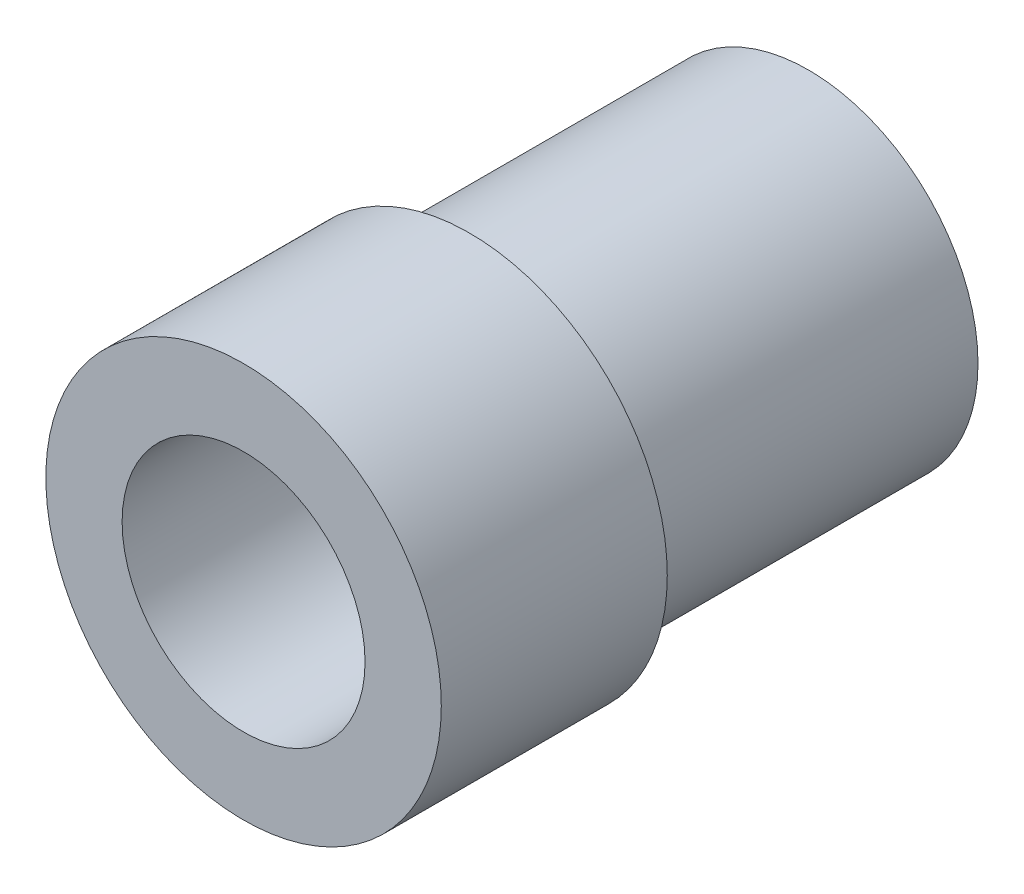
from build123d import *

# Parameters (mm, degrees)
SKETCH1_R           = 3
SKETCH1_R_2         = 2.15
BOSS_EXTRUDE1_DEPTH = 6
SKETCH2_R           = 3.5
SKETCH2_R_2         = 2.15
BOSS_EXTRUDE2_DEPTH = 4


with BuildPart() as part:
    # Sketch1 → Boss-Extrude1 (new body)
    with BuildSketch(Plane.XY):
        Circle(SKETCH1_R)
        Circle(SKETCH1_R_2, mode=Mode.SUBTRACT)
    extrude(amount=BOSS_EXTRUDE1_DEPTH)

    # Sketch2 → Boss-Extrude2 (add)
    with BuildSketch(Plane.XY.offset(6)):
        Circle(SKETCH2_R)
        Circle(SKETCH2_R_2, mode=Mode.SUBTRACT)
    extrude(amount=BOSS_EXTRUDE2_DEPTH)


solid = part.part
